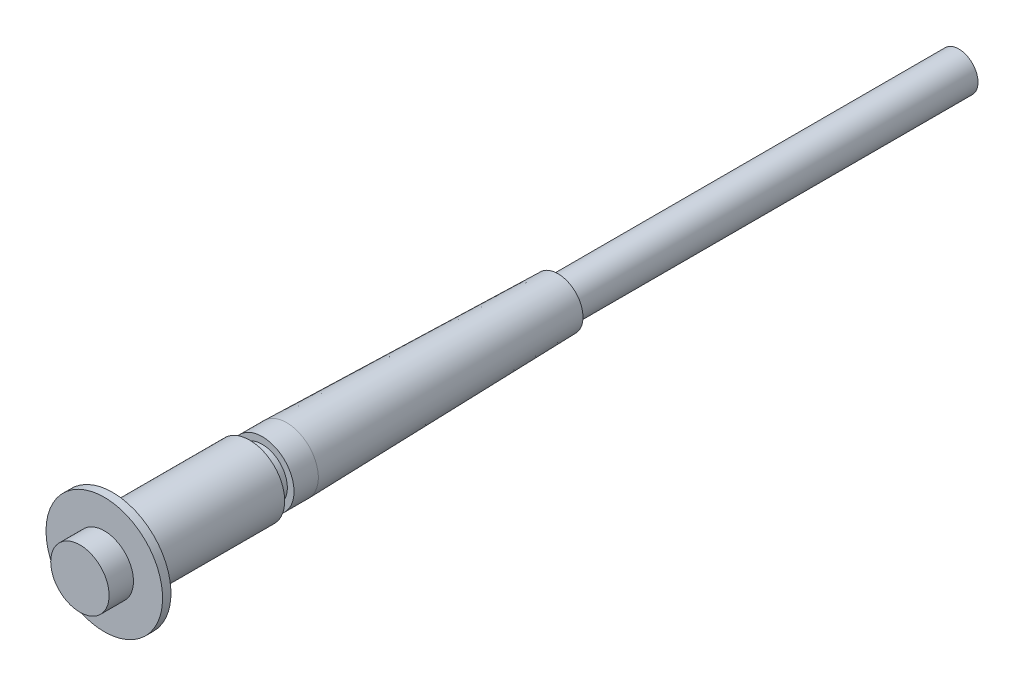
from build123d import *

# Parameters (mm, degrees)
SKETCH3_R      = 14.605
EXTRUDE1_DEPTH = 304.8


with BuildPart() as part:
    # Sketch1 → Revolve1 (revolve)
    with BuildSketch(Plane(origin=(0, 0, 0), x_dir=(1, 0, 0), z_dir=(0, 1, 0))):
        Polygon((0, -18.542), (-22.1996, -18.542), (-22.1996, 0), (-44.323, 0), (-44.323, 6.35), (-26.67, 6.35), (-26.67, 110.49), (-19.05, 110.49), (-19.05, 120.142), (-24.13, 120.142), (-24.13, 138.610224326), (-19.05, 344.932), (0, 344.932), align=None)
    revolve(axis=Axis((0, 0, -204.828193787), (0, 0, 1)))

    # Sketch3 → Extrude1 (add)
    with BuildSketch(Plane(origin=(0, 0, -344.932), x_dir=(-1, 0, 0), z_dir=(0, 0, -1))):
        with Locations(Location((0, 0, 0), (0, 0, 180))):
            Circle(SKETCH3_R)
    extrude(amount=EXTRUDE1_DEPTH)


solid = part.part
